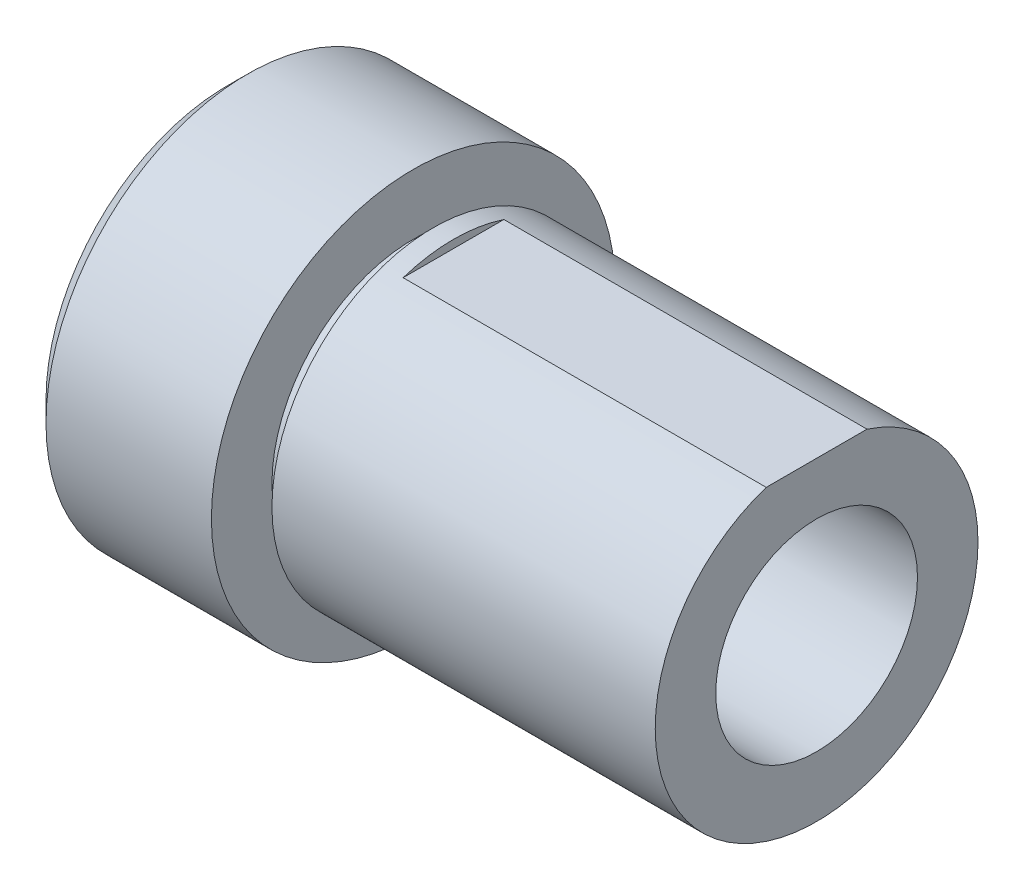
from build123d import *

# Parameters (mm, degrees)
SKETCH1_R           = 5
BOSS_EXTRUDE1_DEPTH = 4.6
SKETCH2_R           = 4
BOSS_EXTRUDE2_DEPTH = 10
SKETCH3_R           = 2.5
CUT_EXTRUDE1_DEPTH  = 17.222207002
CHAMFER1_SIZE       = 0.5
SKETCH4_W           = 9
SKETCH4_H           = 0.2
CUT_EXTRUDE2_DEPTH  = 5
SKETCH5_W           = 0.5
SKETCH5_H           = 0.5


with BuildPart() as part:
    # Sketch1 → Boss-Extrude1 (new body)
    with BuildSketch(Plane(origin=(0, 0, 0), x_dir=(0, 0, -1), z_dir=(1, 0, 0))):
        Circle(SKETCH1_R)
    extrude(amount=BOSS_EXTRUDE1_DEPTH)

    # Sketch2 → Boss-Extrude2 (add)
    with BuildSketch(Plane(origin=(4.6, 0, 0), x_dir=(0, 0, -1), z_dir=(1, 0, 0))):
        Circle(SKETCH2_R)
    extrude(amount=BOSS_EXTRUDE2_DEPTH)

    # Sketch3 → Cut-Extrude1 (cut, through all)
    with BuildSketch(Plane(origin=(14.6, 0, 0), x_dir=(0, 0, -1), z_dir=(1, 0, 0))):
        Circle(SKETCH3_R)
    extrude(amount=-CUT_EXTRUDE1_DEPTH, mode=Mode.SUBTRACT)

    # Chamfer1
    chamfer1_edges = [part.edges().sort_by_distance(p)[0] for p in [
        (0, 0, 5),
    ]]
    chamfer(chamfer1_edges, length=CHAMFER1_SIZE)

    # Sketch4 → Cut-Extrude2 (cut, symmetric)
    with BuildSketch(Plane.XY):
        with Locations((10.1, 3.9)):
            Rectangle(SKETCH4_W, SKETCH4_H)
    extrude(amount=CUT_EXTRUDE2_DEPTH, both=True, mode=Mode.SUBTRACT)

    # Sketch5 → Cut-Revolve2 (revolve, cut)
    with BuildSketch(Plane.XY, mode=Mode.PRIVATE) as cut_revolve2_sk:
        with Locations((4.85, 3.75)):
            Rectangle(SKETCH5_W, SKETCH5_H)
    revolve(cut_revolve2_sk.sketch.rotate(Axis((4.6, 0, 0), (-1, 0, 0)), 341.805127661), axis=Axis((4.6, 0, 0), (-1, 0, 0)), mode=Mode.SUBTRACT)


solid = part.part
